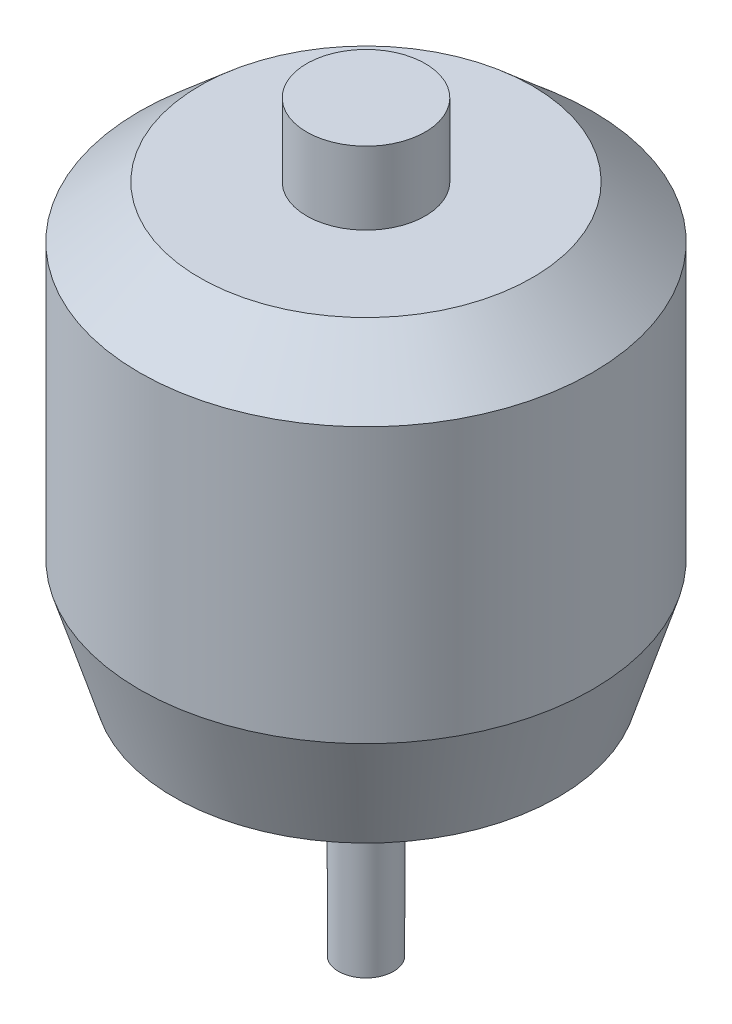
from build123d import *

# Parameters (mm, degrees)
SKETCH1_R           = 20.955
BOSS_EXTRUDE1_DEPTH = 25.4
SKETCH3_R           = 5.4864
BOSS_EXTRUDE2_DEPTH = 6.731
SKETCH5_R           = 2.54
BOSS_EXTRUDE3_DEPTH = 21.59
SKETCH6_R           = 1.27
CUT_EXTRUDE1_DEPTH  = 12.7


with BuildPart() as part:
    # Sketch1 → Boss-Extrude1 (new body)
    with BuildSketch(Plane(origin=(0, 0, 0), x_dir=(1, 0, 0), z_dir=(0, 1, 0))):
        with Locations(Location((0, 0, 0), (0, 0, 270))):
            Circle(SKETCH1_R)
    extrude(amount=BOSS_EXTRUDE1_DEPTH)

    # Sketch2 → Revolve1 (revolve)
    with BuildSketch(Plane(origin=(0, 0, 0), x_dir=(0, 0, -1), z_dir=(1, 0, 0))):
        Polygon((0, 25.4), (20.955, 25.4), (15.3924, 30.226), (0, 30.226), align=None)
    revolve(axis=Axis((0, -974.6, 0), (0, 1, 0)))

    # Sketch3 → Boss-Extrude2 (add)
    with BuildSketch(Plane(origin=(0, 30.226, 0), x_dir=(1, 0, 0), z_dir=(0, 1, 0))):
        with Locations(Location((0, 0, 0), (0, 0, 270))):
            Circle(SKETCH3_R)
    extrude(amount=BOSS_EXTRUDE2_DEPTH)

    # Sketch4 → Revolve2 (revolve)
    with BuildSketch(Plane.XY, mode=Mode.PRIVATE) as revolve2_sk:
        Polygon((0, 0), (0, -10.2108), (-17.78, -10.2108), (-20.955, 0), align=None)
    revolve(revolve2_sk.sketch.rotate(Axis((0, -1000, 0), (0, 1, 0)), 180), axis=Axis((0, -1000, 0), (0, 1, 0)))

    # Sketch5 → Boss-Extrude3 (add)
    with BuildSketch(Plane.XZ.offset(10.2108)):
        with Locations(Location((0, 0, 0), (0, 0, 180))):
            Circle(SKETCH5_R)
    extrude(amount=BOSS_EXTRUDE3_DEPTH)

    # Sketch6 → Cut-Extrude1 (cut)
    with BuildSketch(Plane.XZ.offset(10.2108)):
        with Locations((-8.980256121, 8.980256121)):
            Circle(SKETCH6_R)
        with Locations((8.980256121, 8.980256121)):
            Circle(SKETCH6_R)
        with Locations((8.980256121, -8.980256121)):
            Circle(SKETCH6_R)
        with Locations((-8.980256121, -8.980256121)):
            Circle(SKETCH6_R)
    extrude(amount=-CUT_EXTRUDE1_DEPTH, mode=Mode.SUBTRACT)


solid = part.part
